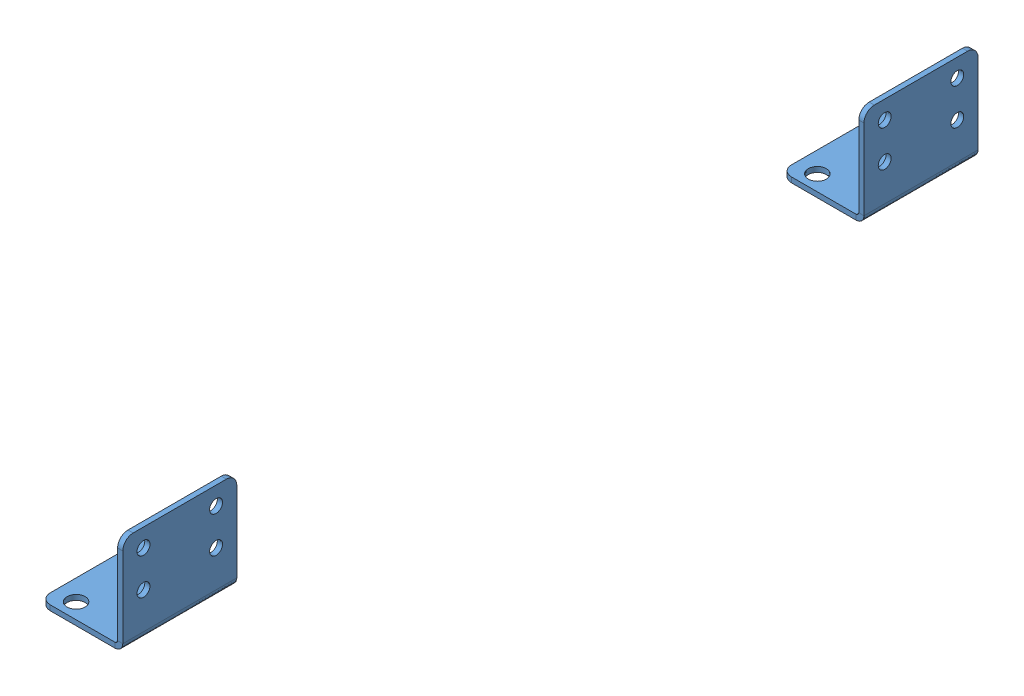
SolidWorks assembly 极限轨道与开关固定座组合.SLDASM, configuration 300 (file format 13000). Lengths in mm.
Overall size (16 19 165).
3 component instances, 2 part files, 6 mates.
Components (placement in the parent):
- SFKK60-LR 极限轨道-1: SFKK60-LR 极限轨道.SLDPRT [300] at (-2.8111 1.1304 150) (suppressed, hidden)
- 开关固定座：KK-674S2-F-1: 开关固定座：KK-674S2-F.SLDPRT [默认] at (8.1889 4.6304 179) x (0 1 0) z (0 0 1)
- 开关固定座：KK-674S2-F-2: 开关固定座：KK-674S2-F.SLDPRT [默认] at (8.1889 4.6304 36) x (0 1 0) z (0 0 1)
Mates (geometry in assembly coordinates):
- 重合1: coincident: plane of assembly; plane of SFKK60-LR 极限轨道-1 through (-6.8111 3.6304 300) normal (0 1 0); plane of 开关固定座：KK-674S2-F-1 through (-6.8111 3.6304 190) normal (0 -1 0)
- 距离1: distance = 110 mm aligned: plane of 开关固定座：KK-674S2-F-1 through (7.6889 5.1304 190) normal (0 0 1); plane of SFKK60-LR 极限轨道-1 through (-2.8111 1.1304 300) normal (0 0 1)
- 重合3: coincident: plane of assembly; plane of SFKK60-LR 极限轨道-1 through (-6.8111 -1.3696 300) normal (-1 0 0); plane of 开关固定座：KK-674S2-F-1 through (-6.8111 3.6304 190) normal (-1 0 0)
- 重合4: coincident aligned: plane of 开关固定座：KK-674S2-F-1 through (-6.8111 4.6304 190) normal (0 1 0); plane of 开关固定座：KK-674S2-F-2 through (-6.8111 4.6304 47) normal (0 1 0)
- 重合5: coincident aligned: plane of 开关固定座：KK-674S2-F-1 through (8.1889 4.6304 190) normal (-1 0 0); plane of 开关固定座：KK-674S2-F-2 through (8.1889 4.6304 47) normal (-1 0 0)
- 距离2: distance = 25 mm: plane of assembly; plane of SFKK60-LR 极限轨道-1 through (-2.8111 1.1304 0) normal (0 0 -1); plane of 开关固定座：KK-674S2-F-2 through (9.1889 5.1304 25) normal (0 0 -1)
